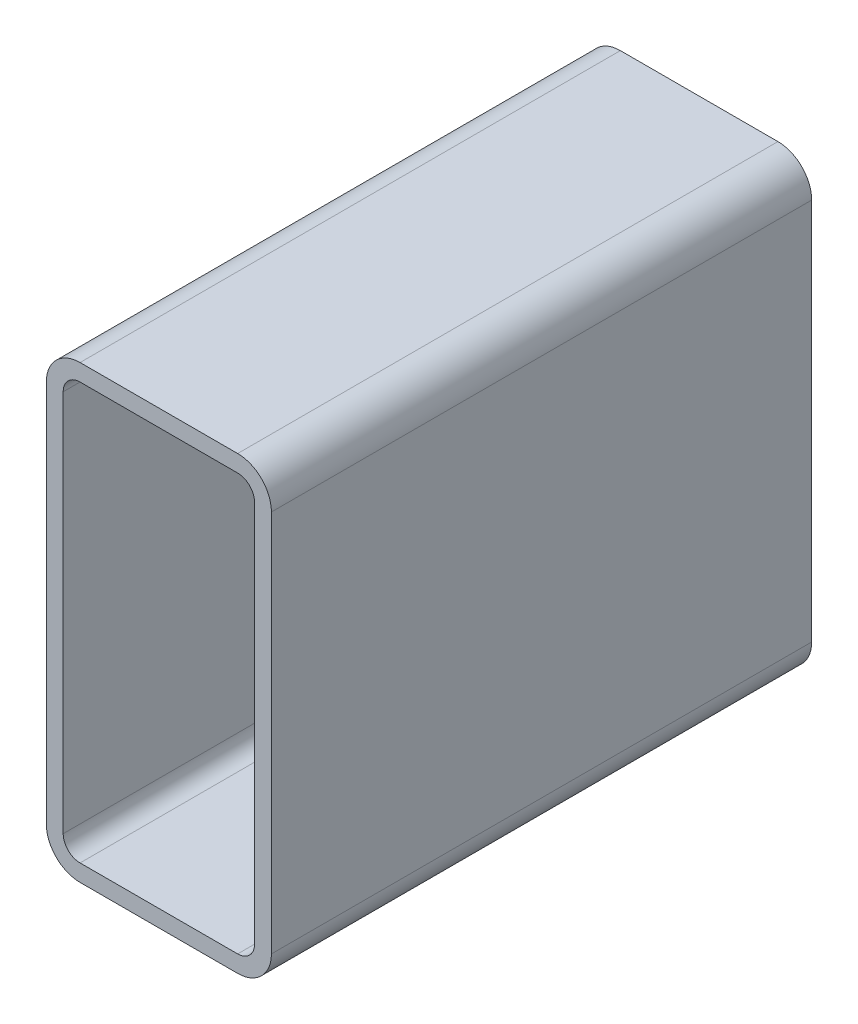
ISO-10303-21;
HEADER;
FILE_DESCRIPTION(('STEP AP214'),'2;1');
FILE_NAME('part.step','',(''),(''),'','','');
FILE_SCHEMA(('AUTOMOTIVE_DESIGN { 1 0 10303 214 1 1 1 1 }'));
ENDSEC;
DATA;
#1=APPLICATION_CONTEXT('core data for automotive mechanical design processes');
#2=APPLICATION_PROTOCOL_DEFINITION('international standard','automotive_design',2000,#1);
#3=PRODUCT_CONTEXT('',#1,'mechanical');
#4=PRODUCT('Part','Part','',(#3));
#5=PRODUCT_RELATED_PRODUCT_CATEGORY('part','',(#4));
#6=PRODUCT_DEFINITION_FORMATION('','',#4);
#7=PRODUCT_DEFINITION_CONTEXT('part definition',#1,'design');
#8=PRODUCT_DEFINITION('design','',#6,#7);
#9=PRODUCT_DEFINITION_SHAPE('','',#8);
#10=(LENGTH_UNIT() NAMED_UNIT(*) SI_UNIT(.MILLI.,.METRE.));
#11=(NAMED_UNIT(*) PLANE_ANGLE_UNIT() SI_UNIT($,.RADIAN.));
#12=(NAMED_UNIT(*) SI_UNIT($,.STERADIAN.) SOLID_ANGLE_UNIT());
#13=UNCERTAINTY_MEASURE_WITH_UNIT(LENGTH_MEASURE(1.E-05),#10,'distance_accuracy_value','');
#14=(GEOMETRIC_REPRESENTATION_CONTEXT(3) GLOBAL_UNCERTAINTY_ASSIGNED_CONTEXT((#13)) GLOBAL_UNIT_ASSIGNED_CONTEXT((#10,
#11,#12)) REPRESENTATION_CONTEXT('',''));
#15=CARTESIAN_POINT('',(0.,0.,0.));
#16=DIRECTION('',(0.,0.,1.));
#17=DIRECTION('',(1.,0.,0.));
#18=AXIS2_PLACEMENT_3D('',#15,#16,#17);
#19=CARTESIAN_POINT('',(19.9112396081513,236.870313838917,304.8));
#20=DIRECTION('',(0.,0.,1.));
#21=DIRECTION('',(1.,0.,0.));
#22=AXIS2_PLACEMENT_3D('',#19,#20,#21);
#23=PLANE('',#22);
#24=CARTESIAN_POINT('',(19.9112396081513,236.870313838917,304.8));
#25=DIRECTION('',(0.,0.,1.));
#26=DIRECTION('',(1.,0.,0.));
#27=AXIS2_PLACEMENT_3D('',#24,#25,#26);
#28=CIRCLE('',#27,19.05);
#29=CARTESIAN_POINT('',(19.9112396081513,255.920313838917,304.8));
#30=VERTEX_POINT('',#29);
#31=CARTESIAN_POINT('',(0.8612396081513,236.870313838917,304.8));
#32=VERTEX_POINT('',#31);
#33=EDGE_CURVE('E211',#30,#32,#28,.T.);
#34=ORIENTED_EDGE('',*,*,#33,.T.);
#35=DIRECTION('',(0.,-1.,0.));
#36=VECTOR('',#35,1.);
#37=CARTESIAN_POINT('',(0.8612396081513,20.9703138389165,304.8));
#38=LINE('',#37,#36);
#39=CARTESIAN_POINT('',(0.861239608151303,20.9703138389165,304.8));
#40=VERTEX_POINT('',#39);
#41=EDGE_CURVE('E214',#32,#40,#38,.T.);
#42=ORIENTED_EDGE('',*,*,#41,.T.);
#43=CARTESIAN_POINT('',(19.9112396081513,20.9703138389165,304.8));
#44=DIRECTION('',(0.,0.,1.));
#45=DIRECTION('',(1.,0.,0.));
#46=AXIS2_PLACEMENT_3D('',#43,#44,#45);
#47=CIRCLE('',#46,19.05);
#48=CARTESIAN_POINT('',(19.9112396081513,1.92031383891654,304.8));
#49=VERTEX_POINT('',#48);
#50=EDGE_CURVE('E217',#40,#49,#47,.T.);
#51=ORIENTED_EDGE('',*,*,#50,.T.);
#52=DIRECTION('',(1.,0.,0.));
#53=VECTOR('',#52,1.);
#54=CARTESIAN_POINT('',(108.811239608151,1.92031383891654,304.8));
#55=LINE('',#54,#53);
#56=CARTESIAN_POINT('',(108.811239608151,1.92031383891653,304.8));
#57=VERTEX_POINT('',#56);
#58=EDGE_CURVE('E219',#49,#57,#55,.T.);
#59=ORIENTED_EDGE('',*,*,#58,.T.);
#60=CARTESIAN_POINT('',(108.811239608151,20.9703138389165,304.8));
#61=DIRECTION('',(0.,0.,1.));
#62=DIRECTION('',(1.,0.,0.));
#63=AXIS2_PLACEMENT_3D('',#60,#61,#62);
#64=CIRCLE('',#63,19.05);
#65=CARTESIAN_POINT('',(127.861239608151,20.9703138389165,304.8));
#66=VERTEX_POINT('',#65);
#67=EDGE_CURVE('E221',#57,#66,#64,.T.);
#68=ORIENTED_EDGE('',*,*,#67,.T.);
#69=DIRECTION('',(0.,1.,0.));
#70=VECTOR('',#69,1.);
#71=CARTESIAN_POINT('',(127.861239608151,236.870313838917,304.8));
#72=LINE('',#71,#70);
#73=CARTESIAN_POINT('',(127.861239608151,236.870313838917,304.8));
#74=VERTEX_POINT('',#73);
#75=EDGE_CURVE('E223',#66,#74,#72,.T.);
#76=ORIENTED_EDGE('',*,*,#75,.T.);
#77=CARTESIAN_POINT('',(108.811239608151,236.870313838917,304.8));
#78=DIRECTION('',(0.,0.,1.));
#79=DIRECTION('',(1.,0.,0.));
#80=AXIS2_PLACEMENT_3D('',#77,#78,#79);
#81=CIRCLE('',#80,19.05);
#82=CARTESIAN_POINT('',(108.811239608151,255.920313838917,304.8));
#83=VERTEX_POINT('',#82);
#84=EDGE_CURVE('E225',#74,#83,#81,.T.);
#85=ORIENTED_EDGE('',*,*,#84,.T.);
#86=DIRECTION('',(-1.,0.,0.));
#87=VECTOR('',#86,1.);
#88=CARTESIAN_POINT('',(19.9112396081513,255.920313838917,304.8));
#89=LINE('',#88,#87);
#90=EDGE_CURVE('E227',#83,#30,#89,.T.);
#91=ORIENTED_EDGE('',*,*,#90,.T.);
#92=EDGE_LOOP('',(#34,#42,#51,#59,#68,#76,#85,#91));
#93=FACE_BOUND('',#92,.T.);
#94=DIRECTION('',(0.,-1.,0.));
#95=VECTOR('',#94,1.);
#96=CARTESIAN_POINT('',(10.3862396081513,20.9703138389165,304.8));
#97=LINE('',#96,#95);
#98=CARTESIAN_POINT('',(10.3862396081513,236.870313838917,304.8));
#99=VERTEX_POINT('',#98);
#100=CARTESIAN_POINT('',(10.3862396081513,20.9703138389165,304.8));
#101=VERTEX_POINT('',#100);
#102=EDGE_CURVE('E154',#99,#101,#97,.T.);
#103=ORIENTED_EDGE('',*,*,#102,.F.);
#104=CARTESIAN_POINT('',(19.9112396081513,236.870313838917,304.8));
#105=DIRECTION('',(0.,0.,1.));
#106=DIRECTION('',(1.,0.,0.));
#107=AXIS2_PLACEMENT_3D('',#104,#105,#106);
#108=CIRCLE('',#107,9.52500000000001);
#109=CARTESIAN_POINT('',(19.9112396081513,246.395313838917,304.8));
#110=VERTEX_POINT('',#109);
#111=EDGE_CURVE('E146',#110,#99,#108,.T.);
#112=ORIENTED_EDGE('',*,*,#111,.F.);
#113=DIRECTION('',(-1.,0.,0.));
#114=VECTOR('',#113,1.);
#115=CARTESIAN_POINT('',(19.9112396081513,246.395313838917,304.8));
#116=LINE('',#115,#114);
#117=CARTESIAN_POINT('',(108.811239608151,246.395313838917,304.8));
#118=VERTEX_POINT('',#117);
#119=EDGE_CURVE('E179',#118,#110,#116,.T.);
#120=ORIENTED_EDGE('',*,*,#119,.F.);
#121=CARTESIAN_POINT('',(108.811239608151,236.870313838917,304.8));
#122=DIRECTION('',(0.,0.,1.));
#123=DIRECTION('',(1.,0.,0.));
#124=AXIS2_PLACEMENT_3D('',#121,#122,#123);
#125=CIRCLE('',#124,9.52500000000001);
#126=CARTESIAN_POINT('',(118.336239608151,236.870313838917,304.8));
#127=VERTEX_POINT('',#126);
#128=EDGE_CURVE('E177',#127,#118,#125,.T.);
#129=ORIENTED_EDGE('',*,*,#128,.F.);
#130=DIRECTION('',(0.,1.,0.));
#131=VECTOR('',#130,1.);
#132=CARTESIAN_POINT('',(118.336239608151,236.870313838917,304.8));
#133=LINE('',#132,#131);
#134=CARTESIAN_POINT('',(118.336239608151,20.9703138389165,304.8));
#135=VERTEX_POINT('',#134);
#136=EDGE_CURVE('E175',#135,#127,#133,.T.);
#137=ORIENTED_EDGE('',*,*,#136,.F.);
#138=CARTESIAN_POINT('',(108.811239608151,20.9703138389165,304.8));
#139=DIRECTION('',(0.,0.,1.));
#140=DIRECTION('',(1.,0.,0.));
#141=AXIS2_PLACEMENT_3D('',#138,#139,#140);
#142=CIRCLE('',#141,9.52500000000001);
#143=CARTESIAN_POINT('',(108.811239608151,11.4453138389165,304.8));
#144=VERTEX_POINT('',#143);
#145=EDGE_CURVE('E173',#144,#135,#142,.T.);
#146=ORIENTED_EDGE('',*,*,#145,.F.);
#147=DIRECTION('',(1.,0.,0.));
#148=VECTOR('',#147,1.);
#149=CARTESIAN_POINT('',(108.811239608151,11.4453138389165,304.8));
#150=LINE('',#149,#148);
#151=CARTESIAN_POINT('',(19.9112396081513,11.4453138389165,304.8));
#152=VERTEX_POINT('',#151);
#153=EDGE_CURVE('E169',#152,#144,#150,.T.);
#154=ORIENTED_EDGE('',*,*,#153,.F.);
#155=CARTESIAN_POINT('',(19.9112396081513,20.9703138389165,304.8));
#156=DIRECTION('',(0.,0.,1.));
#157=DIRECTION('',(1.,0.,0.));
#158=AXIS2_PLACEMENT_3D('',#155,#156,#157);
#159=CIRCLE('',#158,9.525);
#160=EDGE_CURVE('E167',#101,#152,#159,.T.);
#161=ORIENTED_EDGE('',*,*,#160,.F.);
#162=EDGE_LOOP('',(#103,#112,#120,#129,#137,#146,#154,#161));
#163=FACE_BOUND('',#162,.T.);
#164=ADVANCED_FACE('F33',(#93,#163),#23,.T.);
#165=CARTESIAN_POINT('',(19.9112396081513,236.870313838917,0.));
#166=DIRECTION('',(0.,0.,1.));
#167=DIRECTION('',(1.,0.,0.));
#168=AXIS2_PLACEMENT_3D('',#165,#166,#167);
#169=PLANE('',#168);
#170=CARTESIAN_POINT('',(19.9112396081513,236.870313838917,0.));
#171=DIRECTION('',(0.,0.,1.));
#172=DIRECTION('',(1.,0.,0.));
#173=AXIS2_PLACEMENT_3D('',#170,#171,#172);
#174=CIRCLE('',#173,19.05);
#175=CARTESIAN_POINT('',(19.9112396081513,255.920313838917,0.));
#176=VERTEX_POINT('',#175);
#177=CARTESIAN_POINT('',(0.8612396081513,236.870313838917,0.));
#178=VERTEX_POINT('',#177);
#179=EDGE_CURVE('E162',#176,#178,#174,.T.);
#180=ORIENTED_EDGE('',*,*,#179,.F.);
#181=DIRECTION('',(-1.,0.,0.));
#182=VECTOR('',#181,1.);
#183=CARTESIAN_POINT('',(19.9112396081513,255.920313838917,0.));
#184=LINE('',#183,#182);
#185=CARTESIAN_POINT('',(108.811239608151,255.920313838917,0.));
#186=VERTEX_POINT('',#185);
#187=EDGE_CURVE('E215',#186,#176,#184,.T.);
#188=ORIENTED_EDGE('',*,*,#187,.F.);
#189=CARTESIAN_POINT('',(108.811239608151,236.870313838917,0.));
#190=DIRECTION('',(0.,0.,1.));
#191=DIRECTION('',(1.,0.,0.));
#192=AXIS2_PLACEMENT_3D('',#189,#190,#191);
#193=CIRCLE('',#192,19.05);
#194=CARTESIAN_POINT('',(127.861239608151,236.870313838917,0.));
#195=VERTEX_POINT('',#194);
#196=EDGE_CURVE('E242',#195,#186,#193,.T.);
#197=ORIENTED_EDGE('',*,*,#196,.F.);
#198=DIRECTION('',(0.,1.,0.));
#199=VECTOR('',#198,1.);
#200=CARTESIAN_POINT('',(127.861239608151,236.870313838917,0.));
#201=LINE('',#200,#199);
#202=CARTESIAN_POINT('',(127.861239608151,20.9703138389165,0.));
#203=VERTEX_POINT('',#202);
#204=EDGE_CURVE('E240',#203,#195,#201,.T.);
#205=ORIENTED_EDGE('',*,*,#204,.F.);
#206=CARTESIAN_POINT('',(108.811239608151,20.9703138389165,0.));
#207=DIRECTION('',(0.,0.,1.));
#208=DIRECTION('',(1.,0.,0.));
#209=AXIS2_PLACEMENT_3D('',#206,#207,#208);
#210=CIRCLE('',#209,19.05);
#211=CARTESIAN_POINT('',(108.811239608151,1.92031383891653,0.));
#212=VERTEX_POINT('',#211);
#213=EDGE_CURVE('E238',#212,#203,#210,.T.);
#214=ORIENTED_EDGE('',*,*,#213,.F.);
#215=DIRECTION('',(1.,0.,0.));
#216=VECTOR('',#215,1.);
#217=CARTESIAN_POINT('',(108.811239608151,1.92031383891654,0.));
#218=LINE('',#217,#216);
#219=CARTESIAN_POINT('',(19.9112396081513,1.92031383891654,0.));
#220=VERTEX_POINT('',#219);
#221=EDGE_CURVE('E236',#220,#212,#218,.T.);
#222=ORIENTED_EDGE('',*,*,#221,.F.);
#223=CARTESIAN_POINT('',(19.9112396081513,20.9703138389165,0.));
#224=DIRECTION('',(0.,0.,1.));
#225=DIRECTION('',(1.,0.,0.));
#226=AXIS2_PLACEMENT_3D('',#223,#224,#225);
#227=CIRCLE('',#226,19.05);
#228=CARTESIAN_POINT('',(0.861239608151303,20.9703138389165,0.));
#229=VERTEX_POINT('',#228);
#230=EDGE_CURVE('E234',#229,#220,#227,.T.);
#231=ORIENTED_EDGE('',*,*,#230,.F.);
#232=DIRECTION('',(0.,-1.,0.));
#233=VECTOR('',#232,1.);
#234=CARTESIAN_POINT('',(0.8612396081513,20.9703138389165,0.));
#235=LINE('',#234,#233);
#236=EDGE_CURVE('E232',#178,#229,#235,.T.);
#237=ORIENTED_EDGE('',*,*,#236,.F.);
#238=EDGE_LOOP('',(#180,#188,#197,#205,#214,#222,#231,#237));
#239=FACE_BOUND('',#238,.T.);
#240=CARTESIAN_POINT('',(19.9112396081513,236.870313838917,0.));
#241=DIRECTION('',(0.,0.,1.));
#242=DIRECTION('',(1.,0.,0.));
#243=AXIS2_PLACEMENT_3D('',#240,#241,#242);
#244=CIRCLE('',#243,9.52500000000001);
#245=CARTESIAN_POINT('',(19.9112396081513,246.395313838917,0.));
#246=VERTEX_POINT('',#245);
#247=CARTESIAN_POINT('',(10.3862396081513,236.870313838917,0.));
#248=VERTEX_POINT('',#247);
#249=EDGE_CURVE('E56',#246,#248,#244,.T.);
#250=ORIENTED_EDGE('',*,*,#249,.T.);
#251=DIRECTION('',(0.,-1.,0.));
#252=VECTOR('',#251,1.);
#253=CARTESIAN_POINT('',(10.3862396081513,20.9703138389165,0.));
#254=LINE('',#253,#252);
#255=CARTESIAN_POINT('',(10.3862396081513,20.9703138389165,0.));
#256=VERTEX_POINT('',#255);
#257=EDGE_CURVE('E161',#248,#256,#254,.T.);
#258=ORIENTED_EDGE('',*,*,#257,.T.);
#259=CARTESIAN_POINT('',(19.9112396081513,20.9703138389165,0.));
#260=DIRECTION('',(0.,0.,1.));
#261=DIRECTION('',(1.,0.,0.));
#262=AXIS2_PLACEMENT_3D('',#259,#260,#261);
#263=CIRCLE('',#262,9.525);
#264=CARTESIAN_POINT('',(19.9112396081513,11.4453138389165,0.));
#265=VERTEX_POINT('',#264);
#266=EDGE_CURVE('E183',#256,#265,#263,.T.);
#267=ORIENTED_EDGE('',*,*,#266,.T.);
#268=DIRECTION('',(1.,0.,0.));
#269=VECTOR('',#268,1.);
#270=CARTESIAN_POINT('',(108.811239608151,11.4453138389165,0.));
#271=LINE('',#270,#269);
#272=CARTESIAN_POINT('',(108.811239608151,11.4453138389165,0.));
#273=VERTEX_POINT('',#272);
#274=EDGE_CURVE('E186',#265,#273,#271,.T.);
#275=ORIENTED_EDGE('',*,*,#274,.T.);
#276=CARTESIAN_POINT('',(108.811239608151,20.9703138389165,0.));
#277=DIRECTION('',(0.,0.,1.));
#278=DIRECTION('',(1.,0.,0.));
#279=AXIS2_PLACEMENT_3D('',#276,#277,#278);
#280=CIRCLE('',#279,9.52500000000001);
#281=CARTESIAN_POINT('',(118.336239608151,20.9703138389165,0.));
#282=VERTEX_POINT('',#281);
#283=EDGE_CURVE('E189',#273,#282,#280,.T.);
#284=ORIENTED_EDGE('',*,*,#283,.T.);
#285=DIRECTION('',(0.,1.,0.));
#286=VECTOR('',#285,1.);
#287=CARTESIAN_POINT('',(118.336239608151,236.870313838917,0.));
#288=LINE('',#287,#286);
#289=CARTESIAN_POINT('',(118.336239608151,236.870313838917,0.));
#290=VERTEX_POINT('',#289);
#291=EDGE_CURVE('E192',#282,#290,#288,.T.);
#292=ORIENTED_EDGE('',*,*,#291,.T.);
#293=CARTESIAN_POINT('',(108.811239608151,236.870313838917,0.));
#294=DIRECTION('',(0.,0.,1.));
#295=DIRECTION('',(1.,0.,0.));
#296=AXIS2_PLACEMENT_3D('',#293,#294,#295);
#297=CIRCLE('',#296,9.52500000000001);
#298=CARTESIAN_POINT('',(108.811239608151,246.395313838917,0.));
#299=VERTEX_POINT('',#298);
#300=EDGE_CURVE('E195',#290,#299,#297,.T.);
#301=ORIENTED_EDGE('',*,*,#300,.T.);
#302=DIRECTION('',(-1.,0.,0.));
#303=VECTOR('',#302,1.);
#304=CARTESIAN_POINT('',(19.9112396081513,246.395313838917,0.));
#305=LINE('',#304,#303);
#306=EDGE_CURVE('E155',#299,#246,#305,.T.);
#307=ORIENTED_EDGE('',*,*,#306,.T.);
#308=EDGE_LOOP('',(#250,#258,#267,#275,#284,#292,#301,#307));
#309=FACE_BOUND('',#308,.T.);
#310=ADVANCED_FACE('F272',(#239,#309),#169,.F.);
#311=CARTESIAN_POINT('',(19.9112396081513,236.870313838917,304.8));
#312=DIRECTION('',(0.,0.,-1.));
#313=DIRECTION('',(-1.,0.,0.));
#314=AXIS2_PLACEMENT_3D('',#311,#312,#313);
#315=CYLINDRICAL_SURFACE('',#314,19.05);
#316=ORIENTED_EDGE('',*,*,#179,.T.);
#317=DIRECTION('',(0.,0.,-1.));
#318=VECTOR('',#317,1.);
#319=CARTESIAN_POINT('',(0.8612396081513,236.870313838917,304.8));
#320=LINE('',#319,#318);
#321=EDGE_CURVE('E11',#32,#178,#320,.T.);
#322=ORIENTED_EDGE('',*,*,#321,.F.);
#323=ORIENTED_EDGE('',*,*,#33,.F.);
#324=DIRECTION('',(0.,0.,-1.));
#325=VECTOR('',#324,1.);
#326=CARTESIAN_POINT('',(19.9112396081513,255.920313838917,304.8));
#327=LINE('',#326,#325);
#328=EDGE_CURVE('E229',#30,#176,#327,.T.);
#329=ORIENTED_EDGE('',*,*,#328,.T.);
#330=EDGE_LOOP('',(#316,#322,#323,#329));
#331=FACE_BOUND('',#330,.T.);
#332=ADVANCED_FACE('F35',(#331),#315,.T.);
#333=CARTESIAN_POINT('',(0.8612396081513,20.9703138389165,304.8));
#334=DIRECTION('',(1.,0.,0.));
#335=DIRECTION('',(0.,0.,-1.));
#336=AXIS2_PLACEMENT_3D('',#333,#334,#335);
#337=PLANE('',#336);
#338=ORIENTED_EDGE('',*,*,#236,.T.);
#339=DIRECTION('',(0.,0.,-1.));
#340=VECTOR('',#339,1.);
#341=CARTESIAN_POINT('',(0.861239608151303,20.9703138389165,304.8));
#342=LINE('',#341,#340);
#343=EDGE_CURVE('E41',#40,#229,#342,.T.);
#344=ORIENTED_EDGE('',*,*,#343,.F.);
#345=ORIENTED_EDGE('',*,*,#41,.F.);
#346=ORIENTED_EDGE('',*,*,#321,.T.);
#347=EDGE_LOOP('',(#338,#344,#345,#346));
#348=FACE_BOUND('',#347,.T.);
#349=ADVANCED_FACE('F289',(#348),#337,.F.);
#350=CARTESIAN_POINT('',(19.9112396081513,20.9703138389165,304.8));
#351=DIRECTION('',(0.,0.,-1.));
#352=DIRECTION('',(-1.,0.,0.));
#353=AXIS2_PLACEMENT_3D('',#350,#351,#352);
#354=CYLINDRICAL_SURFACE('',#353,19.05);
#355=ORIENTED_EDGE('',*,*,#230,.T.);
#356=DIRECTION('',(0.,0.,-1.));
#357=VECTOR('',#356,1.);
#358=CARTESIAN_POINT('',(19.9112396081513,1.92031383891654,304.8));
#359=LINE('',#358,#357);
#360=EDGE_CURVE('E259',#49,#220,#359,.T.);
#361=ORIENTED_EDGE('',*,*,#360,.F.);
#362=ORIENTED_EDGE('',*,*,#50,.F.);
#363=ORIENTED_EDGE('',*,*,#343,.T.);
#364=EDGE_LOOP('',(#355,#361,#362,#363));
#365=FACE_BOUND('',#364,.T.);
#366=ADVANCED_FACE('F266',(#365),#354,.T.);
#367=CARTESIAN_POINT('',(108.811239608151,1.92031383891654,304.8));
#368=DIRECTION('',(0.,1.,0.));
#369=DIRECTION('',(0.,0.,1.));
#370=AXIS2_PLACEMENT_3D('',#367,#368,#369);
#371=PLANE('',#370);
#372=ORIENTED_EDGE('',*,*,#221,.T.);
#373=DIRECTION('',(0.,0.,-1.));
#374=VECTOR('',#373,1.);
#375=CARTESIAN_POINT('',(108.811239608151,1.92031383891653,304.8));
#376=LINE('',#375,#374);
#377=EDGE_CURVE('E256',#57,#212,#376,.T.);
#378=ORIENTED_EDGE('',*,*,#377,.F.);
#379=ORIENTED_EDGE('',*,*,#58,.F.);
#380=ORIENTED_EDGE('',*,*,#360,.T.);
#381=EDGE_LOOP('',(#372,#378,#379,#380));
#382=FACE_BOUND('',#381,.T.);
#383=ADVANCED_FACE('F278',(#382),#371,.F.);
#384=CARTESIAN_POINT('',(108.811239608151,20.9703138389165,304.8));
#385=DIRECTION('',(0.,0.,-1.));
#386=DIRECTION('',(-1.,0.,0.));
#387=AXIS2_PLACEMENT_3D('',#384,#385,#386);
#388=CYLINDRICAL_SURFACE('',#387,19.05);
#389=ORIENTED_EDGE('',*,*,#213,.T.);
#390=DIRECTION('',(0.,0.,-1.));
#391=VECTOR('',#390,1.);
#392=CARTESIAN_POINT('',(127.861239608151,20.9703138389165,304.8));
#393=LINE('',#392,#391);
#394=EDGE_CURVE('E253',#66,#203,#393,.T.);
#395=ORIENTED_EDGE('',*,*,#394,.F.);
#396=ORIENTED_EDGE('',*,*,#67,.F.);
#397=ORIENTED_EDGE('',*,*,#377,.T.);
#398=EDGE_LOOP('',(#389,#395,#396,#397));
#399=FACE_BOUND('',#398,.T.);
#400=ADVANCED_FACE('F282',(#399),#388,.T.);
#401=CARTESIAN_POINT('',(127.861239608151,236.870313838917,304.8));
#402=DIRECTION('',(-1.,0.,0.));
#403=DIRECTION('',(0.,0.,1.));
#404=AXIS2_PLACEMENT_3D('',#401,#402,#403);
#405=PLANE('',#404);
#406=ORIENTED_EDGE('',*,*,#204,.T.);
#407=DIRECTION('',(0.,0.,-1.));
#408=VECTOR('',#407,1.);
#409=CARTESIAN_POINT('',(127.861239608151,236.870313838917,304.8));
#410=LINE('',#409,#408);
#411=EDGE_CURVE('E250',#74,#195,#410,.T.);
#412=ORIENTED_EDGE('',*,*,#411,.F.);
#413=ORIENTED_EDGE('',*,*,#75,.F.);
#414=ORIENTED_EDGE('',*,*,#394,.T.);
#415=EDGE_LOOP('',(#406,#412,#413,#414));
#416=FACE_BOUND('',#415,.T.);
#417=ADVANCED_FACE('F302',(#416),#405,.F.);
#418=CARTESIAN_POINT('',(108.811239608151,236.870313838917,304.8));
#419=DIRECTION('',(0.,0.,-1.));
#420=DIRECTION('',(-1.,0.,0.));
#421=AXIS2_PLACEMENT_3D('',#418,#419,#420);
#422=CYLINDRICAL_SURFACE('',#421,19.05);
#423=ORIENTED_EDGE('',*,*,#196,.T.);
#424=DIRECTION('',(0.,0.,-1.));
#425=VECTOR('',#424,1.);
#426=CARTESIAN_POINT('',(108.811239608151,255.920313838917,304.8));
#427=LINE('',#426,#425);
#428=EDGE_CURVE('E247',#83,#186,#427,.T.);
#429=ORIENTED_EDGE('',*,*,#428,.F.);
#430=ORIENTED_EDGE('',*,*,#84,.F.);
#431=ORIENTED_EDGE('',*,*,#411,.T.);
#432=EDGE_LOOP('',(#423,#429,#430,#431));
#433=FACE_BOUND('',#432,.T.);
#434=ADVANCED_FACE('F300',(#433),#422,.T.);
#435=CARTESIAN_POINT('',(19.9112396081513,255.920313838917,304.8));
#436=DIRECTION('',(0.,-1.,0.));
#437=DIRECTION('',(0.,0.,-1.));
#438=AXIS2_PLACEMENT_3D('',#435,#436,#437);
#439=PLANE('',#438);
#440=ORIENTED_EDGE('',*,*,#187,.T.);
#441=ORIENTED_EDGE('',*,*,#328,.F.);
#442=ORIENTED_EDGE('',*,*,#90,.F.);
#443=ORIENTED_EDGE('',*,*,#428,.T.);
#444=EDGE_LOOP('',(#440,#441,#442,#443));
#445=FACE_BOUND('',#444,.T.);
#446=ADVANCED_FACE('F295',(#445),#439,.F.);
#447=CARTESIAN_POINT('',(19.9112396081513,236.870313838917,304.8));
#448=DIRECTION('',(0.,0.,-1.));
#449=DIRECTION('',(-1.,0.,0.));
#450=AXIS2_PLACEMENT_3D('',#447,#448,#449);
#451=CYLINDRICAL_SURFACE('',#450,9.52500000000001);
#452=ORIENTED_EDGE('',*,*,#249,.F.);
#453=DIRECTION('',(0.,0.,-1.));
#454=VECTOR('',#453,1.);
#455=CARTESIAN_POINT('',(19.9112396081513,246.395313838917,304.8));
#456=LINE('',#455,#454);
#457=EDGE_CURVE('E150',#110,#246,#456,.T.);
#458=ORIENTED_EDGE('',*,*,#457,.F.);
#459=ORIENTED_EDGE('',*,*,#111,.T.);
#460=DIRECTION('',(0.,0.,-1.));
#461=VECTOR('',#460,1.);
#462=CARTESIAN_POINT('',(10.3862396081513,236.870313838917,304.8));
#463=LINE('',#462,#461);
#464=EDGE_CURVE('E149',#99,#248,#463,.T.);
#465=ORIENTED_EDGE('',*,*,#464,.T.);
#466=EDGE_LOOP('',(#452,#458,#459,#465));
#467=FACE_BOUND('',#466,.T.);
#468=ADVANCED_FACE('F148',(#467),#451,.F.);
#469=CARTESIAN_POINT('',(10.3862396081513,20.9703138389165,304.8));
#470=DIRECTION('',(1.,0.,0.));
#471=DIRECTION('',(0.,0.,-1.));
#472=AXIS2_PLACEMENT_3D('',#469,#470,#471);
#473=PLANE('',#472);
#474=ORIENTED_EDGE('',*,*,#257,.F.);
#475=ORIENTED_EDGE('',*,*,#464,.F.);
#476=ORIENTED_EDGE('',*,*,#102,.T.);
#477=DIRECTION('',(0.,0.,-1.));
#478=VECTOR('',#477,1.);
#479=CARTESIAN_POINT('',(10.3862396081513,20.9703138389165,304.8));
#480=LINE('',#479,#478);
#481=EDGE_CURVE('E163',#101,#256,#480,.T.);
#482=ORIENTED_EDGE('',*,*,#481,.T.);
#483=EDGE_LOOP('',(#474,#475,#476,#482));
#484=FACE_BOUND('',#483,.T.);
#485=ADVANCED_FACE('F158',(#484),#473,.T.);
#486=CARTESIAN_POINT('',(19.9112396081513,20.9703138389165,304.8));
#487=DIRECTION('',(0.,0.,-1.));
#488=DIRECTION('',(-1.,0.,0.));
#489=AXIS2_PLACEMENT_3D('',#486,#487,#488);
#490=CYLINDRICAL_SURFACE('',#489,9.525);
#491=ORIENTED_EDGE('',*,*,#266,.F.);
#492=ORIENTED_EDGE('',*,*,#481,.F.);
#493=ORIENTED_EDGE('',*,*,#160,.T.);
#494=DIRECTION('',(0.,0.,-1.));
#495=VECTOR('',#494,1.);
#496=CARTESIAN_POINT('',(19.9112396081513,11.4453138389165,304.8));
#497=LINE('',#496,#495);
#498=EDGE_CURVE('E208',#152,#265,#497,.T.);
#499=ORIENTED_EDGE('',*,*,#498,.T.);
#500=EDGE_LOOP('',(#491,#492,#493,#499));
#501=FACE_BOUND('',#500,.T.);
#502=ADVANCED_FACE('F327',(#501),#490,.F.);
#503=CARTESIAN_POINT('',(108.811239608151,11.4453138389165,304.8));
#504=DIRECTION('',(0.,1.,0.));
#505=DIRECTION('',(0.,0.,1.));
#506=AXIS2_PLACEMENT_3D('',#503,#504,#505);
#507=PLANE('',#506);
#508=ORIENTED_EDGE('',*,*,#274,.F.);
#509=ORIENTED_EDGE('',*,*,#498,.F.);
#510=ORIENTED_EDGE('',*,*,#153,.T.);
#511=DIRECTION('',(0.,0.,-1.));
#512=VECTOR('',#511,1.);
#513=CARTESIAN_POINT('',(108.811239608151,11.4453138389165,304.8));
#514=LINE('',#513,#512);
#515=EDGE_CURVE('E206',#144,#273,#514,.T.);
#516=ORIENTED_EDGE('',*,*,#515,.T.);
#517=EDGE_LOOP('',(#508,#509,#510,#516));
#518=FACE_BOUND('',#517,.T.);
#519=ADVANCED_FACE('F331',(#518),#507,.T.);
#520=CARTESIAN_POINT('',(108.811239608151,20.9703138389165,304.8));
#521=DIRECTION('',(0.,0.,-1.));
#522=DIRECTION('',(-1.,0.,0.));
#523=AXIS2_PLACEMENT_3D('',#520,#521,#522);
#524=CYLINDRICAL_SURFACE('',#523,9.52500000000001);
#525=ORIENTED_EDGE('',*,*,#283,.F.);
#526=ORIENTED_EDGE('',*,*,#515,.F.);
#527=ORIENTED_EDGE('',*,*,#145,.T.);
#528=DIRECTION('',(0.,0.,-1.));
#529=VECTOR('',#528,1.);
#530=CARTESIAN_POINT('',(118.336239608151,20.9703138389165,304.8));
#531=LINE('',#530,#529);
#532=EDGE_CURVE('E204',#135,#282,#531,.T.);
#533=ORIENTED_EDGE('',*,*,#532,.T.);
#534=EDGE_LOOP('',(#525,#526,#527,#533));
#535=FACE_BOUND('',#534,.T.);
#536=ADVANCED_FACE('F337',(#535),#524,.F.);
#537=CARTESIAN_POINT('',(118.336239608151,236.870313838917,304.8));
#538=DIRECTION('',(-1.,0.,0.));
#539=DIRECTION('',(0.,0.,1.));
#540=AXIS2_PLACEMENT_3D('',#537,#538,#539);
#541=PLANE('',#540);
#542=ORIENTED_EDGE('',*,*,#291,.F.);
#543=ORIENTED_EDGE('',*,*,#532,.F.);
#544=ORIENTED_EDGE('',*,*,#136,.T.);
#545=DIRECTION('',(0.,0.,-1.));
#546=VECTOR('',#545,1.);
#547=CARTESIAN_POINT('',(118.336239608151,236.870313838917,304.8));
#548=LINE('',#547,#546);
#549=EDGE_CURVE('E202',#127,#290,#548,.T.);
#550=ORIENTED_EDGE('',*,*,#549,.T.);
#551=EDGE_LOOP('',(#542,#543,#544,#550));
#552=FACE_BOUND('',#551,.T.);
#553=ADVANCED_FACE('F341',(#552),#541,.T.);
#554=CARTESIAN_POINT('',(108.811239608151,236.870313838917,304.8));
#555=DIRECTION('',(0.,0.,-1.));
#556=DIRECTION('',(-1.,0.,0.));
#557=AXIS2_PLACEMENT_3D('',#554,#555,#556);
#558=CYLINDRICAL_SURFACE('',#557,9.52500000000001);
#559=ORIENTED_EDGE('',*,*,#300,.F.);
#560=ORIENTED_EDGE('',*,*,#549,.F.);
#561=ORIENTED_EDGE('',*,*,#128,.T.);
#562=DIRECTION('',(0.,0.,-1.));
#563=VECTOR('',#562,1.);
#564=CARTESIAN_POINT('',(108.811239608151,246.395313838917,304.8));
#565=LINE('',#564,#563);
#566=EDGE_CURVE('E48',#118,#299,#565,.T.);
#567=ORIENTED_EDGE('',*,*,#566,.T.);
#568=EDGE_LOOP('',(#559,#560,#561,#567));
#569=FACE_BOUND('',#568,.T.);
#570=ADVANCED_FACE('F345',(#569),#558,.F.);
#571=CARTESIAN_POINT('',(19.9112396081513,246.395313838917,304.8));
#572=DIRECTION('',(0.,-1.,0.));
#573=DIRECTION('',(0.,0.,-1.));
#574=AXIS2_PLACEMENT_3D('',#571,#572,#573);
#575=PLANE('',#574);
#576=ORIENTED_EDGE('',*,*,#306,.F.);
#577=ORIENTED_EDGE('',*,*,#566,.F.);
#578=ORIENTED_EDGE('',*,*,#119,.T.);
#579=ORIENTED_EDGE('',*,*,#457,.T.);
#580=EDGE_LOOP('',(#576,#577,#578,#579));
#581=FACE_BOUND('',#580,.T.);
#582=ADVANCED_FACE('F349',(#581),#575,.T.);
#583=CLOSED_SHELL('',(#164,#310,#332,#349,#366,#383,#400,#417,#434,#446,#468,#485,#502,#519,
#536,#553,#570,#582));
#584=MANIFOLD_SOLID_BREP('B2',#583);
#585=ADVANCED_BREP_SHAPE_REPRESENTATION('',(#18,#584),#14);
#586=SHAPE_DEFINITION_REPRESENTATION(#9,#585);
ENDSEC;
END-ISO-10303-21;
